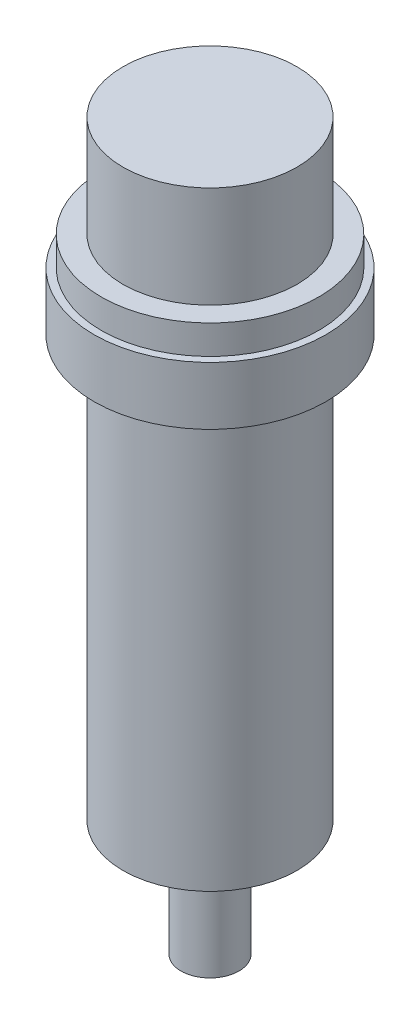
from build123d import *

# Parameters (mm, degrees)
SKETCH_1_R      = 8
EXTRUDE_1_DEPTH = 4
SKETCH_2_R      = 7.5
EXTRUDE_2_DEPTH = 2
SKETCH_3_R      = 6
EXTRUDE_3_DEPTH = 7
EXTRUDE_START   = 29
SKETCH_4_R      = 6
EXTRUDE_4_DEPTH = 29
SKETCH_5_R      = 2
EXTRUDE_5_DEPTH = 8


with BuildPart() as part:
    # Sketch 1 → Extrude 1 (new body)
    with BuildSketch(Plane(origin=(0, 0, 0), x_dir=(1, 0, 0), z_dir=(0, 1, 0))):
        with Locations(Location((0, 0, 0), (0, 0, 270))):
            Circle(SKETCH_1_R)
    extrude(amount=EXTRUDE_1_DEPTH)

    # Sketch 2 → Extrude 2 (add)
    with BuildSketch(Plane(origin=(0, 4, 0), x_dir=(1, 0, 0), z_dir=(0, 1, 0))):
        with Locations(Location((0, 0, 0), (0, 0, 270))):
            Circle(SKETCH_2_R)
    extrude(amount=EXTRUDE_2_DEPTH)

    # Sketch 3 → Extrude 3 (add)
    with BuildSketch(Plane(origin=(0, 6, 0), x_dir=(1, 0, 0), z_dir=(0, 1, 0))):
        with Locations(Location((0, 0, 0), (0, 0, 270))):
            Circle(SKETCH_3_R)
    extrude(amount=EXTRUDE_3_DEPTH)

    # Sketch 4 → Extrude 4 (add)
    with BuildSketch(Plane.XZ.offset(EXTRUDE_START)):
        with Locations(Location((0, 0, 0), (0, 0, 90))):
            Circle(SKETCH_4_R)
    extrude(amount=-EXTRUDE_4_DEPTH)

    # Sketch 5 → Extrude 5 (add)
    with BuildSketch(Plane.XZ.offset(29)):
        with Locations(Location((0, 0, 0), (0, 0, 270))):
            Circle(SKETCH_5_R)
    extrude(amount=EXTRUDE_5_DEPTH)


solid = part.part
